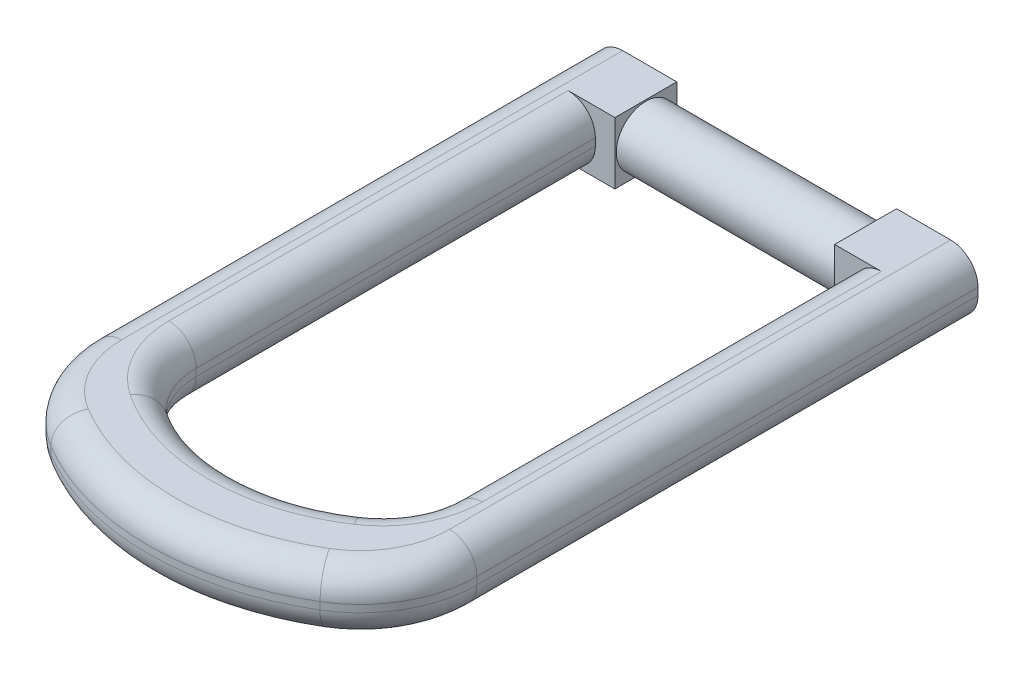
ISO-10303-21;
HEADER;
FILE_DESCRIPTION(('STEP AP214'),'2;1');
FILE_NAME('part.step','',(''),(''),'','','');
FILE_SCHEMA(('AUTOMOTIVE_DESIGN { 1 0 10303 214 1 1 1 1 }'));
ENDSEC;
DATA;
#1=APPLICATION_CONTEXT('core data for automotive mechanical design processes');
#2=APPLICATION_PROTOCOL_DEFINITION('international standard','automotive_design',2000,#1);
#3=PRODUCT_CONTEXT('',#1,'mechanical');
#4=PRODUCT('Part','Part','',(#3));
#5=PRODUCT_RELATED_PRODUCT_CATEGORY('part','',(#4));
#6=PRODUCT_DEFINITION_FORMATION('','',#4);
#7=PRODUCT_DEFINITION_CONTEXT('part definition',#1,'design');
#8=PRODUCT_DEFINITION('design','',#6,#7);
#9=PRODUCT_DEFINITION_SHAPE('','',#8);
#10=(LENGTH_UNIT() NAMED_UNIT(*) SI_UNIT(.MILLI.,.METRE.));
#11=(NAMED_UNIT(*) PLANE_ANGLE_UNIT() SI_UNIT($,.RADIAN.));
#12=(NAMED_UNIT(*) SI_UNIT($,.STERADIAN.) SOLID_ANGLE_UNIT());
#13=UNCERTAINTY_MEASURE_WITH_UNIT(LENGTH_MEASURE(1.E-05),#10,'distance_accuracy_value','');
#14=(GEOMETRIC_REPRESENTATION_CONTEXT(3) GLOBAL_UNCERTAINTY_ASSIGNED_CONTEXT((#13)) GLOBAL_UNIT_ASSIGNED_CONTEXT((#10,
#11,#12)) REPRESENTATION_CONTEXT('',''));
#15=CARTESIAN_POINT('',(0.,0.,0.));
#16=DIRECTION('',(0.,0.,1.));
#17=DIRECTION('',(1.,0.,0.));
#18=AXIS2_PLACEMENT_3D('',#15,#16,#17);
#19=CARTESIAN_POINT('',(-32.9,-13.6,206.712725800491));
#20=DIRECTION('',(0.,1.,0.));
#21=DIRECTION('',(-1.,0.,0.));
#22=AXIS2_PLACEMENT_3D('',#19,#20,#21);
#23=PLANE('',#22);
#24=DIRECTION('',(1.,0.,0.));
#25=VECTOR('',#24,1.);
#26=CARTESIAN_POINT('',(-84.1,-13.6,-13.6));
#27=LINE('',#26,#25);
#28=CARTESIAN_POINT('',(48.3,-13.6,-13.6));
#29=VERTEX_POINT('',#28);
#30=CARTESIAN_POINT('',(72.1,-13.6,-13.6));
#31=VERTEX_POINT('',#30);
#32=EDGE_CURVE('E379',#29,#31,#27,.T.);
#33=ORIENTED_EDGE('',*,*,#32,.T.);
#34=DIRECTION('',(0.,0.,1.));
#35=VECTOR('',#34,1.);
#36=CARTESIAN_POINT('',(72.1,-13.6,206.712725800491));
#37=LINE('',#36,#35);
#38=CARTESIAN_POINT('',(72.1,-13.6,206.712725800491));
#39=VERTEX_POINT('',#38);
#40=EDGE_CURVE('E248',#31,#39,#37,.T.);
#41=ORIENTED_EDGE('',*,*,#40,.T.);
#42=CARTESIAN_POINT('',(32.9,-13.6,206.712725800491));
#43=DIRECTION('',(0.,1.,0.));
#44=DIRECTION('',(-1.,0.,0.));
#45=AXIS2_PLACEMENT_3D('',#42,#43,#44);
#46=CIRCLE('',#45,39.2);
#47=CARTESIAN_POINT('',(53.0198127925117,-13.6,240.355453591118));
#48=VERTEX_POINT('',#47);
#49=EDGE_CURVE('E246',#39,#48,#46,.F.);
#50=ORIENTED_EDGE('',*,*,#49,.T.);
#51=CARTESIAN_POINT('',(0.,-13.6,151.7));
#52=DIRECTION('',(0.,1.,0.));
#53=DIRECTION('',(-1.,0.,0.));
#54=AXIS2_PLACEMENT_3D('',#51,#52,#53);
#55=CIRCLE('',#54,103.3);
#56=CARTESIAN_POINT('',(-53.0198127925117,-13.6,240.355453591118));
#57=VERTEX_POINT('',#56);
#58=EDGE_CURVE('E244',#48,#57,#55,.F.);
#59=ORIENTED_EDGE('',*,*,#58,.T.);
#60=CARTESIAN_POINT('',(-32.9,-13.6,206.712725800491));
#61=DIRECTION('',(0.,1.,0.));
#62=DIRECTION('',(-1.,0.,0.));
#63=AXIS2_PLACEMENT_3D('',#60,#61,#62);
#64=CIRCLE('',#63,39.2);
#65=CARTESIAN_POINT('',(-72.1,-13.6,206.712725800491));
#66=VERTEX_POINT('',#65);
#67=EDGE_CURVE('E242',#57,#66,#64,.F.);
#68=ORIENTED_EDGE('',*,*,#67,.T.);
#69=DIRECTION('',(0.,0.,-1.));
#70=VECTOR('',#69,1.);
#71=CARTESIAN_POINT('',(-72.1,-13.6,206.712725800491));
#72=LINE('',#71,#70);
#73=CARTESIAN_POINT('',(-72.1,-13.6,-13.6));
#74=VERTEX_POINT('',#73);
#75=EDGE_CURVE('E240',#66,#74,#72,.T.);
#76=ORIENTED_EDGE('',*,*,#75,.T.);
#77=CARTESIAN_POINT('',(-48.3,-13.6,-13.6));
#78=VERTEX_POINT('',#77);
#79=EDGE_CURVE('E222',#74,#78,#27,.T.);
#80=ORIENTED_EDGE('',*,*,#79,.T.);
#81=DIRECTION('',(0.,0.,1.));
#82=VECTOR('',#81,1.);
#83=CARTESIAN_POINT('',(-48.3,-13.6,30.5));
#84=LINE('',#83,#82);
#85=CARTESIAN_POINT('',(-48.3,-13.6,13.6));
#86=VERTEX_POINT('',#85);
#87=EDGE_CURVE('E203',#78,#86,#84,.T.);
#88=ORIENTED_EDGE('',*,*,#87,.T.);
#89=DIRECTION('',(1.,0.,0.));
#90=VECTOR('',#89,1.);
#91=CARTESIAN_POINT('',(-56.9,-13.6,13.6));
#92=LINE('',#91,#90);
#93=CARTESIAN_POINT('',(-68.9,-13.6,13.6));
#94=VERTEX_POINT('',#93);
#95=EDGE_CURVE('E211',#94,#86,#92,.T.);
#96=ORIENTED_EDGE('',*,*,#95,.F.);
#97=DIRECTION('',(0.,0.,-1.));
#98=VECTOR('',#97,1.);
#99=CARTESIAN_POINT('',(-68.9,-13.6,189.063083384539));
#100=LINE('',#99,#98);
#101=CARTESIAN_POINT('',(-68.9,-13.6,189.063083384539));
#102=VERTEX_POINT('',#101);
#103=EDGE_CURVE('E226',#94,#102,#100,.F.);
#104=ORIENTED_EDGE('',*,*,#103,.T.);
#105=CARTESIAN_POINT('',(-24.9,-13.6,189.063083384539));
#106=DIRECTION('',(0.,1.,0.));
#107=DIRECTION('',(-1.,0.,0.));
#108=AXIS2_PLACEMENT_3D('',#105,#106,#107);
#109=CIRCLE('',#108,44.);
#110=CARTESIAN_POINT('',(-49.3008908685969,-13.6,225.677240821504));
#111=VERTEX_POINT('',#110);
#112=EDGE_CURVE('E231',#102,#111,#109,.T.);
#113=ORIENTED_EDGE('',*,*,#112,.T.);
#114=CARTESIAN_POINT('',(0.,-13.6,151.7));
#115=DIRECTION('',(0.,1.,0.));
#116=DIRECTION('',(-1.,0.,0.));
#117=AXIS2_PLACEMENT_3D('',#114,#115,#116);
#118=CIRCLE('',#117,88.9);
#119=CARTESIAN_POINT('',(49.3008908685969,-13.6,225.677240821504));
#120=VERTEX_POINT('',#119);
#121=EDGE_CURVE('E233',#111,#120,#118,.T.);
#122=ORIENTED_EDGE('',*,*,#121,.T.);
#123=CARTESIAN_POINT('',(24.9,-13.6,189.063083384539));
#124=DIRECTION('',(0.,1.,0.));
#125=DIRECTION('',(-1.,0.,0.));
#126=AXIS2_PLACEMENT_3D('',#123,#124,#125);
#127=CIRCLE('',#126,44.);
#128=CARTESIAN_POINT('',(68.9,-13.6,189.063083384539));
#129=VERTEX_POINT('',#128);
#130=EDGE_CURVE('E235',#120,#129,#127,.T.);
#131=ORIENTED_EDGE('',*,*,#130,.T.);
#132=DIRECTION('',(0.,0.,1.));
#133=VECTOR('',#132,1.);
#134=CARTESIAN_POINT('',(68.9,-13.6,13.6));
#135=LINE('',#134,#133);
#136=CARTESIAN_POINT('',(68.9,-13.6,13.6));
#137=VERTEX_POINT('',#136);
#138=EDGE_CURVE('E237',#129,#137,#135,.F.);
#139=ORIENTED_EDGE('',*,*,#138,.T.);
#140=CARTESIAN_POINT('',(48.3,-13.6,13.6));
#141=VERTEX_POINT('',#140);
#142=EDGE_CURVE('E218',#141,#137,#92,.T.);
#143=ORIENTED_EDGE('',*,*,#142,.F.);
#144=DIRECTION('',(0.,0.,-1.));
#145=VECTOR('',#144,1.);
#146=CARTESIAN_POINT('',(48.3,-13.6,30.5));
#147=LINE('',#146,#145);
#148=EDGE_CURVE('E208',#141,#29,#147,.T.);
#149=ORIENTED_EDGE('',*,*,#148,.T.);
#150=EDGE_LOOP('',(#33,#41,#50,#59,#68,#76,#80,#88,#96,#104,#113,#122,#131,#139,#143,#149));
#151=FACE_BOUND('',#150,.T.);
#152=ADVANCED_FACE('F14',(#151),#23,.F.);
#153=CARTESIAN_POINT('',(-32.9,13.6,206.712725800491));
#154=DIRECTION('',(0.,1.,0.));
#155=DIRECTION('',(-1.,0.,0.));
#156=AXIS2_PLACEMENT_3D('',#153,#154,#155);
#157=PLANE('',#156);
#158=CARTESIAN_POINT('',(32.9,13.6,206.712725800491));
#159=DIRECTION('',(0.,1.,0.));
#160=DIRECTION('',(-1.,0.,0.));
#161=AXIS2_PLACEMENT_3D('',#158,#159,#160);
#162=CIRCLE('',#161,39.2);
#163=CARTESIAN_POINT('',(53.0198127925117,13.6,240.355453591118));
#164=VERTEX_POINT('',#163);
#165=CARTESIAN_POINT('',(72.1,13.6,206.712725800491));
#166=VERTEX_POINT('',#165);
#167=EDGE_CURVE('E286',#164,#166,#162,.T.);
#168=ORIENTED_EDGE('',*,*,#167,.T.);
#169=DIRECTION('',(0.,0.,1.));
#170=VECTOR('',#169,1.);
#171=CARTESIAN_POINT('',(72.1,13.6,-13.6));
#172=LINE('',#171,#170);
#173=CARTESIAN_POINT('',(72.1,13.6,-13.6));
#174=VERTEX_POINT('',#173);
#175=EDGE_CURVE('E288',#166,#174,#172,.F.);
#176=ORIENTED_EDGE('',*,*,#175,.T.);
#177=DIRECTION('',(1.,0.,0.));
#178=VECTOR('',#177,1.);
#179=CARTESIAN_POINT('',(-84.1,13.6,-13.6));
#180=LINE('',#179,#178);
#181=CARTESIAN_POINT('',(48.3,13.6,-13.6));
#182=VERTEX_POINT('',#181);
#183=EDGE_CURVE('E375',#182,#174,#180,.T.);
#184=ORIENTED_EDGE('',*,*,#183,.F.);
#185=DIRECTION('',(0.,0.,-1.));
#186=VECTOR('',#185,1.);
#187=CARTESIAN_POINT('',(48.3,13.6,30.5));
#188=LINE('',#187,#186);
#189=CARTESIAN_POINT('',(48.3,13.6,13.6));
#190=VERTEX_POINT('',#189);
#191=EDGE_CURVE('E345',#190,#182,#188,.T.);
#192=ORIENTED_EDGE('',*,*,#191,.F.);
#193=DIRECTION('',(1.,0.,0.));
#194=VECTOR('',#193,1.);
#195=CARTESIAN_POINT('',(-56.9,13.6,13.6));
#196=LINE('',#195,#194);
#197=CARTESIAN_POINT('',(68.9,13.6,13.6));
#198=VERTEX_POINT('',#197);
#199=EDGE_CURVE('E349',#190,#198,#196,.T.);
#200=ORIENTED_EDGE('',*,*,#199,.T.);
#201=DIRECTION('',(0.,0.,1.));
#202=VECTOR('',#201,1.);
#203=CARTESIAN_POINT('',(68.9,13.6,206.712725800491));
#204=LINE('',#203,#202);
#205=CARTESIAN_POINT('',(68.9,13.6,189.063083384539));
#206=VERTEX_POINT('',#205);
#207=EDGE_CURVE('E278',#198,#206,#204,.T.);
#208=ORIENTED_EDGE('',*,*,#207,.T.);
#209=CARTESIAN_POINT('',(24.9,13.6,189.063083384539));
#210=DIRECTION('',(0.,1.,0.));
#211=DIRECTION('',(-1.,0.,0.));
#212=AXIS2_PLACEMENT_3D('',#209,#210,#211);
#213=CIRCLE('',#212,44.);
#214=CARTESIAN_POINT('',(49.3008908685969,13.6,225.677240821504));
#215=VERTEX_POINT('',#214);
#216=EDGE_CURVE('E276',#206,#215,#213,.F.);
#217=ORIENTED_EDGE('',*,*,#216,.T.);
#218=CARTESIAN_POINT('',(0.,13.6,151.7));
#219=DIRECTION('',(0.,1.,0.));
#220=DIRECTION('',(-1.,0.,0.));
#221=AXIS2_PLACEMENT_3D('',#218,#219,#220);
#222=CIRCLE('',#221,88.9);
#223=CARTESIAN_POINT('',(-49.3008908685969,13.6,225.677240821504));
#224=VERTEX_POINT('',#223);
#225=EDGE_CURVE('E273',#215,#224,#222,.F.);
#226=ORIENTED_EDGE('',*,*,#225,.T.);
#227=CARTESIAN_POINT('',(-24.9,13.6,189.063083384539));
#228=DIRECTION('',(0.,1.,0.));
#229=DIRECTION('',(-1.,0.,0.));
#230=AXIS2_PLACEMENT_3D('',#227,#228,#229);
#231=CIRCLE('',#230,44.);
#232=CARTESIAN_POINT('',(-68.9,13.6,189.063083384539));
#233=VERTEX_POINT('',#232);
#234=EDGE_CURVE('E271',#224,#233,#231,.F.);
#235=ORIENTED_EDGE('',*,*,#234,.T.);
#236=DIRECTION('',(0.,0.,-1.));
#237=VECTOR('',#236,1.);
#238=CARTESIAN_POINT('',(-68.9,13.6,206.712725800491));
#239=LINE('',#238,#237);
#240=CARTESIAN_POINT('',(-68.9,13.6,13.6));
#241=VERTEX_POINT('',#240);
#242=EDGE_CURVE('E268',#233,#241,#239,.T.);
#243=ORIENTED_EDGE('',*,*,#242,.T.);
#244=CARTESIAN_POINT('',(-48.3,13.6,13.6));
#245=VERTEX_POINT('',#244);
#246=EDGE_CURVE('E355',#241,#245,#196,.T.);
#247=ORIENTED_EDGE('',*,*,#246,.T.);
#248=DIRECTION('',(0.,0.,1.));
#249=VECTOR('',#248,1.);
#250=CARTESIAN_POINT('',(-48.3,13.6,30.5));
#251=LINE('',#250,#249);
#252=CARTESIAN_POINT('',(-48.3,13.6,-13.6));
#253=VERTEX_POINT('',#252);
#254=EDGE_CURVE('E206',#253,#245,#251,.T.);
#255=ORIENTED_EDGE('',*,*,#254,.F.);
#256=CARTESIAN_POINT('',(-72.1,13.6,-13.6));
#257=VERTEX_POINT('',#256);
#258=EDGE_CURVE('E376',#257,#253,#180,.T.);
#259=ORIENTED_EDGE('',*,*,#258,.F.);
#260=DIRECTION('',(0.,0.,-1.));
#261=VECTOR('',#260,1.);
#262=CARTESIAN_POINT('',(-72.1,13.6,206.712725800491));
#263=LINE('',#262,#261);
#264=CARTESIAN_POINT('',(-72.1,13.6,206.712725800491));
#265=VERTEX_POINT('',#264);
#266=EDGE_CURVE('E280',#257,#265,#263,.F.);
#267=ORIENTED_EDGE('',*,*,#266,.T.);
#268=CARTESIAN_POINT('',(-32.9,13.6,206.712725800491));
#269=DIRECTION('',(0.,1.,0.));
#270=DIRECTION('',(-1.,0.,0.));
#271=AXIS2_PLACEMENT_3D('',#268,#269,#270);
#272=CIRCLE('',#271,39.2);
#273=CARTESIAN_POINT('',(-53.0198127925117,13.6,240.355453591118));
#274=VERTEX_POINT('',#273);
#275=EDGE_CURVE('E282',#265,#274,#272,.T.);
#276=ORIENTED_EDGE('',*,*,#275,.T.);
#277=CARTESIAN_POINT('',(0.,13.6,151.7));
#278=DIRECTION('',(0.,1.,0.));
#279=DIRECTION('',(-1.,0.,0.));
#280=AXIS2_PLACEMENT_3D('',#277,#278,#279);
#281=CIRCLE('',#280,103.3);
#282=EDGE_CURVE('E284',#274,#164,#281,.T.);
#283=ORIENTED_EDGE('',*,*,#282,.T.);
#284=EDGE_LOOP('',(#168,#176,#184,#192,#200,#208,#217,#226,#235,#243,#247,#255,#259,#267,#276,#283));
#285=FACE_BOUND('',#284,.T.);
#286=ADVANCED_FACE('F406',(#285),#157,.T.);
#287=CARTESIAN_POINT('',(-84.1,-13.6,-13.6));
#288=DIRECTION('',(0.,0.,1.));
#289=DIRECTION('',(0.,1.,0.));
#290=AXIS2_PLACEMENT_3D('',#287,#288,#289);
#291=PLANE('',#290);
#292=DIRECTION('',(0.,1.,0.));
#293=VECTOR('',#292,1.);
#294=CARTESIAN_POINT('',(84.1,-13.6,-13.6));
#295=LINE('',#294,#293);
#296=CARTESIAN_POINT('',(84.1,-1.6,-13.6));
#297=VERTEX_POINT('',#296);
#298=CARTESIAN_POINT('',(84.1,1.6,-13.6));
#299=VERTEX_POINT('',#298);
#300=EDGE_CURVE('E381',#297,#299,#295,.T.);
#301=ORIENTED_EDGE('',*,*,#300,.F.);
#302=CARTESIAN_POINT('',(72.1,-1.6,-13.6));
#303=DIRECTION('',(0.,0.,1.));
#304=DIRECTION('',(0.,1.,0.));
#305=AXIS2_PLACEMENT_3D('',#302,#303,#304);
#306=CIRCLE('',#305,12.);
#307=EDGE_CURVE('E257',#297,#31,#306,.F.);
#308=ORIENTED_EDGE('',*,*,#307,.T.);
#309=ORIENTED_EDGE('',*,*,#32,.F.);
#310=DIRECTION('',(0.,1.,0.));
#311=VECTOR('',#310,1.);
#312=CARTESIAN_POINT('',(48.3,30.8,-13.6));
#313=LINE('',#312,#311);
#314=EDGE_CURVE('E342',#29,#182,#313,.T.);
#315=ORIENTED_EDGE('',*,*,#314,.T.);
#316=ORIENTED_EDGE('',*,*,#183,.T.);
#317=CARTESIAN_POINT('',(72.1,1.6,-13.6));
#318=DIRECTION('',(0.,0.,1.));
#319=DIRECTION('',(0.,1.,0.));
#320=AXIS2_PLACEMENT_3D('',#317,#318,#319);
#321=CIRCLE('',#320,12.);
#322=EDGE_CURVE('E255',#174,#299,#321,.F.);
#323=ORIENTED_EDGE('',*,*,#322,.T.);
#324=EDGE_LOOP('',(#301,#308,#309,#315,#316,#323));
#325=FACE_BOUND('',#324,.T.);
#326=ADVANCED_FACE('F404',(#325),#291,.F.);
#327=DIRECTION('',(0.,1.,0.));
#328=VECTOR('',#327,1.);
#329=CARTESIAN_POINT('',(-84.1,-13.6,-13.6));
#330=LINE('',#329,#328);
#331=CARTESIAN_POINT('',(-84.1,-1.6,-13.6));
#332=VERTEX_POINT('',#331);
#333=CARTESIAN_POINT('',(-84.1,1.6,-13.6));
#334=VERTEX_POINT('',#333);
#335=EDGE_CURVE('E384',#332,#334,#330,.T.);
#336=ORIENTED_EDGE('',*,*,#335,.T.);
#337=CARTESIAN_POINT('',(-72.1,1.6,-13.6));
#338=DIRECTION('',(0.,0.,1.));
#339=DIRECTION('',(0.,1.,0.));
#340=AXIS2_PLACEMENT_3D('',#337,#338,#339);
#341=CIRCLE('',#340,12.);
#342=EDGE_CURVE('E317',#334,#257,#341,.F.);
#343=ORIENTED_EDGE('',*,*,#342,.T.);
#344=ORIENTED_EDGE('',*,*,#258,.T.);
#345=DIRECTION('',(0.,-1.,0.));
#346=VECTOR('',#345,1.);
#347=CARTESIAN_POINT('',(-48.3,30.8,-13.6));
#348=LINE('',#347,#346);
#349=EDGE_CURVE('E224',#253,#78,#348,.T.);
#350=ORIENTED_EDGE('',*,*,#349,.T.);
#351=ORIENTED_EDGE('',*,*,#79,.F.);
#352=CARTESIAN_POINT('',(-72.1,-1.6,-13.6));
#353=DIRECTION('',(0.,0.,1.));
#354=DIRECTION('',(0.,1.,0.));
#355=AXIS2_PLACEMENT_3D('',#352,#353,#354);
#356=CIRCLE('',#355,12.);
#357=EDGE_CURVE('E315',#74,#332,#356,.F.);
#358=ORIENTED_EDGE('',*,*,#357,.T.);
#359=EDGE_LOOP('',(#336,#343,#344,#350,#351,#358));
#360=FACE_BOUND('',#359,.T.);
#361=ADVANCED_FACE('F520',(#360),#291,.F.);
#362=CARTESIAN_POINT('',(-56.9,-13.6,13.6));
#363=DIRECTION('',(0.,0.,1.));
#364=DIRECTION('',(0.,1.,0.));
#365=AXIS2_PLACEMENT_3D('',#362,#363,#364);
#366=PLANE('',#365);
#367=DIRECTION('',(0.,1.,0.));
#368=VECTOR('',#367,1.);
#369=CARTESIAN_POINT('',(48.3,30.8,13.6));
#370=LINE('',#369,#368);
#371=EDGE_CURVE('E339',#141,#190,#370,.T.);
#372=ORIENTED_EDGE('',*,*,#371,.F.);
#373=ORIENTED_EDGE('',*,*,#142,.T.);
#374=CARTESIAN_POINT('',(68.9,-1.6,13.6));
#375=DIRECTION('',(0.,0.,1.));
#376=DIRECTION('',(0.,1.,0.));
#377=AXIS2_PLACEMENT_3D('',#374,#375,#376);
#378=CIRCLE('',#377,12.);
#379=CARTESIAN_POINT('',(56.9,-1.6,13.6));
#380=VERTEX_POINT('',#379);
#381=EDGE_CURVE('E325',#137,#380,#378,.F.);
#382=ORIENTED_EDGE('',*,*,#381,.T.);
#383=DIRECTION('',(0.,1.,0.));
#384=VECTOR('',#383,1.);
#385=CARTESIAN_POINT('',(56.9,-13.6,13.6));
#386=LINE('',#385,#384);
#387=CARTESIAN_POINT('',(56.9,1.6,13.6));
#388=VERTEX_POINT('',#387);
#389=EDGE_CURVE('E372',#380,#388,#386,.T.);
#390=ORIENTED_EDGE('',*,*,#389,.T.);
#391=CARTESIAN_POINT('',(68.9,1.6,13.6));
#392=DIRECTION('',(0.,0.,1.));
#393=DIRECTION('',(0.,1.,0.));
#394=AXIS2_PLACEMENT_3D('',#391,#392,#393);
#395=CIRCLE('',#394,12.);
#396=EDGE_CURVE('E322',#388,#198,#395,.F.);
#397=ORIENTED_EDGE('',*,*,#396,.T.);
#398=ORIENTED_EDGE('',*,*,#199,.F.);
#399=EDGE_LOOP('',(#372,#373,#382,#390,#397,#398));
#400=FACE_BOUND('',#399,.T.);
#401=ADVANCED_FACE('F348',(#400),#366,.T.);
#402=DIRECTION('',(0.,-1.,0.));
#403=VECTOR('',#402,1.);
#404=CARTESIAN_POINT('',(-48.3,30.8,13.6));
#405=LINE('',#404,#403);
#406=EDGE_CURVE('E199',#245,#86,#405,.T.);
#407=ORIENTED_EDGE('',*,*,#406,.F.);
#408=ORIENTED_EDGE('',*,*,#246,.F.);
#409=CARTESIAN_POINT('',(-68.9,1.6,13.6));
#410=DIRECTION('',(0.,0.,1.));
#411=DIRECTION('',(0.,1.,0.));
#412=AXIS2_PLACEMENT_3D('',#409,#410,#411);
#413=CIRCLE('',#412,12.);
#414=CARTESIAN_POINT('',(-56.9,1.6,13.6));
#415=VERTEX_POINT('',#414);
#416=EDGE_CURVE('E29',#241,#415,#413,.F.);
#417=ORIENTED_EDGE('',*,*,#416,.T.);
#418=DIRECTION('',(0.,1.,0.));
#419=VECTOR('',#418,1.);
#420=CARTESIAN_POINT('',(-56.9,-13.6,13.6));
#421=LINE('',#420,#419);
#422=CARTESIAN_POINT('',(-56.9,-1.6,13.6));
#423=VERTEX_POINT('',#422);
#424=EDGE_CURVE('E217',#423,#415,#421,.T.);
#425=ORIENTED_EDGE('',*,*,#424,.F.);
#426=CARTESIAN_POINT('',(-68.9,-1.6,13.6));
#427=DIRECTION('',(0.,0.,1.));
#428=DIRECTION('',(0.,1.,0.));
#429=AXIS2_PLACEMENT_3D('',#426,#427,#428);
#430=CIRCLE('',#429,12.);
#431=EDGE_CURVE('E214',#423,#94,#430,.F.);
#432=ORIENTED_EDGE('',*,*,#431,.T.);
#433=ORIENTED_EDGE('',*,*,#95,.T.);
#434=EDGE_LOOP('',(#407,#408,#417,#425,#432,#433));
#435=FACE_BOUND('',#434,.T.);
#436=ADVANCED_FACE('F212',(#435),#366,.T.);
#437=CARTESIAN_POINT('',(84.1,-13.6,206.712725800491));
#438=DIRECTION('',(-1.,0.,0.));
#439=DIRECTION('',(0.,0.,1.));
#440=AXIS2_PLACEMENT_3D('',#437,#438,#439);
#441=PLANE('',#440);
#442=DIRECTION('',(0.,1.,0.));
#443=VECTOR('',#442,1.);
#444=CARTESIAN_POINT('',(84.1,-13.6,206.712725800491));
#445=LINE('',#444,#443);
#446=CARTESIAN_POINT('',(84.1,-1.6,206.712725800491));
#447=VERTEX_POINT('',#446);
#448=CARTESIAN_POINT('',(84.1,1.6,206.712725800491));
#449=VERTEX_POINT('',#448);
#450=EDGE_CURVE('E351',#447,#449,#445,.T.);
#451=ORIENTED_EDGE('',*,*,#450,.F.);
#452=DIRECTION('',(0.,0.,1.));
#453=VECTOR('',#452,1.);
#454=CARTESIAN_POINT('',(84.1,-1.6,206.712725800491));
#455=LINE('',#454,#453);
#456=EDGE_CURVE('E253',#447,#297,#455,.F.);
#457=ORIENTED_EDGE('',*,*,#456,.T.);
#458=ORIENTED_EDGE('',*,*,#300,.T.);
#459=DIRECTION('',(0.,0.,1.));
#460=VECTOR('',#459,1.);
#461=CARTESIAN_POINT('',(84.1,1.6,206.712725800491));
#462=LINE('',#461,#460);
#463=EDGE_CURVE('E251',#299,#449,#462,.T.);
#464=ORIENTED_EDGE('',*,*,#463,.T.);
#465=EDGE_LOOP('',(#451,#457,#458,#464));
#466=FACE_BOUND('',#465,.T.);
#467=ADVANCED_FACE('F16',(#466),#441,.F.);
#468=CARTESIAN_POINT('',(32.9,-13.6,206.712725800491));
#469=DIRECTION('',(0.,1.,0.));
#470=DIRECTION('',(-1.,0.,0.));
#471=AXIS2_PLACEMENT_3D('',#468,#469,#470);
#472=CYLINDRICAL_SURFACE('',#471,51.2);
#473=DIRECTION('',(0.,1.,0.));
#474=VECTOR('',#473,1.);
#475=CARTESIAN_POINT('',(59.1789391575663,-13.6,250.654247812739));
#476=LINE('',#475,#474);
#477=CARTESIAN_POINT('',(59.1789391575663,-1.6,250.654247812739));
#478=VERTEX_POINT('',#477);
#479=CARTESIAN_POINT('',(59.1789391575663,1.6,250.654247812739));
#480=VERTEX_POINT('',#479);
#481=EDGE_CURVE('E393',#478,#480,#476,.T.);
#482=ORIENTED_EDGE('',*,*,#481,.F.);
#483=CARTESIAN_POINT('',(32.9,-1.6,206.712725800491));
#484=DIRECTION('',(0.,1.,0.));
#485=DIRECTION('',(-1.,0.,0.));
#486=AXIS2_PLACEMENT_3D('',#483,#484,#485);
#487=CIRCLE('',#486,51.2);
#488=EDGE_CURVE('E261',#478,#447,#487,.T.);
#489=ORIENTED_EDGE('',*,*,#488,.T.);
#490=ORIENTED_EDGE('',*,*,#450,.T.);
#491=CARTESIAN_POINT('',(32.9,1.6,206.712725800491));
#492=DIRECTION('',(0.,1.,0.));
#493=DIRECTION('',(-1.,0.,0.));
#494=AXIS2_PLACEMENT_3D('',#491,#492,#493);
#495=CIRCLE('',#494,51.2);
#496=EDGE_CURVE('E259',#449,#480,#495,.F.);
#497=ORIENTED_EDGE('',*,*,#496,.T.);
#498=EDGE_LOOP('',(#482,#489,#490,#497));
#499=FACE_BOUND('',#498,.T.);
#500=ADVANCED_FACE('F501',(#499),#472,.T.);
#501=CARTESIAN_POINT('',(0.,-13.6,151.7));
#502=DIRECTION('',(0.,1.,0.));
#503=DIRECTION('',(-1.,0.,0.));
#504=AXIS2_PLACEMENT_3D('',#501,#502,#503);
#505=CYLINDRICAL_SURFACE('',#504,115.3);
#506=ORIENTED_EDGE('',*,*,#481,.T.);
#507=CARTESIAN_POINT('',(0.,1.6,151.7));
#508=DIRECTION('',(0.,1.,0.));
#509=DIRECTION('',(-1.,0.,0.));
#510=AXIS2_PLACEMENT_3D('',#507,#508,#509);
#511=CIRCLE('',#510,115.3);
#512=CARTESIAN_POINT('',(-59.1789391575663,1.6,250.654247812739));
#513=VERTEX_POINT('',#512);
#514=EDGE_CURVE('E265',#480,#513,#511,.F.);
#515=ORIENTED_EDGE('',*,*,#514,.T.);
#516=DIRECTION('',(0.,1.,0.));
#517=VECTOR('',#516,1.);
#518=CARTESIAN_POINT('',(-59.1789391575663,-13.6,250.654247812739));
#519=LINE('',#518,#517);
#520=CARTESIAN_POINT('',(-59.1789391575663,-1.6,250.654247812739));
#521=VERTEX_POINT('',#520);
#522=EDGE_CURVE('E390',#521,#513,#519,.T.);
#523=ORIENTED_EDGE('',*,*,#522,.F.);
#524=CARTESIAN_POINT('',(0.,-1.6,151.7));
#525=DIRECTION('',(0.,1.,0.));
#526=DIRECTION('',(-1.,0.,0.));
#527=AXIS2_PLACEMENT_3D('',#524,#525,#526);
#528=CIRCLE('',#527,115.3);
#529=EDGE_CURVE('E263',#521,#478,#528,.T.);
#530=ORIENTED_EDGE('',*,*,#529,.T.);
#531=EDGE_LOOP('',(#506,#515,#523,#530));
#532=FACE_BOUND('',#531,.T.);
#533=ADVANCED_FACE('F487',(#532),#505,.T.);
#534=CARTESIAN_POINT('',(-32.9,-13.6,206.712725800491));
#535=DIRECTION('',(0.,1.,0.));
#536=DIRECTION('',(-1.,0.,0.));
#537=AXIS2_PLACEMENT_3D('',#534,#535,#536);
#538=CYLINDRICAL_SURFACE('',#537,51.2);
#539=ORIENTED_EDGE('',*,*,#522,.T.);
#540=CARTESIAN_POINT('',(-32.9,1.6,206.712725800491));
#541=DIRECTION('',(0.,1.,0.));
#542=DIRECTION('',(-1.,0.,0.));
#543=AXIS2_PLACEMENT_3D('',#540,#541,#542);
#544=CIRCLE('',#543,51.2);
#545=CARTESIAN_POINT('',(-84.1,1.6,206.712725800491));
#546=VERTEX_POINT('',#545);
#547=EDGE_CURVE('E301',#513,#546,#544,.F.);
#548=ORIENTED_EDGE('',*,*,#547,.T.);
#549=DIRECTION('',(0.,1.,0.));
#550=VECTOR('',#549,1.);
#551=CARTESIAN_POINT('',(-84.1,-13.6,206.712725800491));
#552=LINE('',#551,#550);
#553=CARTESIAN_POINT('',(-84.1,-1.6,206.712725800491));
#554=VERTEX_POINT('',#553);
#555=EDGE_CURVE('E387',#554,#546,#552,.T.);
#556=ORIENTED_EDGE('',*,*,#555,.F.);
#557=CARTESIAN_POINT('',(-32.9,-1.6,206.712725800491));
#558=DIRECTION('',(0.,1.,0.));
#559=DIRECTION('',(-1.,0.,0.));
#560=AXIS2_PLACEMENT_3D('',#557,#558,#559);
#561=CIRCLE('',#560,51.2);
#562=EDGE_CURVE('E299',#554,#521,#561,.T.);
#563=ORIENTED_EDGE('',*,*,#562,.T.);
#564=EDGE_LOOP('',(#539,#548,#556,#563));
#565=FACE_BOUND('',#564,.T.);
#566=ADVANCED_FACE('F491',(#565),#538,.T.);
#567=CARTESIAN_POINT('',(-84.1,-13.6,206.712725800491));
#568=DIRECTION('',(1.,0.,0.));
#569=DIRECTION('',(0.,0.,-1.));
#570=AXIS2_PLACEMENT_3D('',#567,#568,#569);
#571=PLANE('',#570);
#572=ORIENTED_EDGE('',*,*,#555,.T.);
#573=DIRECTION('',(0.,0.,-1.));
#574=VECTOR('',#573,1.);
#575=CARTESIAN_POINT('',(-84.1,1.6,-13.6));
#576=LINE('',#575,#574);
#577=EDGE_CURVE('E313',#546,#334,#576,.T.);
#578=ORIENTED_EDGE('',*,*,#577,.T.);
#579=ORIENTED_EDGE('',*,*,#335,.F.);
#580=DIRECTION('',(0.,0.,-1.));
#581=VECTOR('',#580,1.);
#582=CARTESIAN_POINT('',(-84.1,-1.6,206.712725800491));
#583=LINE('',#582,#581);
#584=EDGE_CURVE('E311',#332,#554,#583,.F.);
#585=ORIENTED_EDGE('',*,*,#584,.T.);
#586=EDGE_LOOP('',(#572,#578,#579,#585));
#587=FACE_BOUND('',#586,.T.);
#588=ADVANCED_FACE('F523',(#587),#571,.F.);
#589=CARTESIAN_POINT('',(56.9,-13.6,189.063083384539));
#590=DIRECTION('',(-1.,0.,0.));
#591=DIRECTION('',(0.,0.,1.));
#592=AXIS2_PLACEMENT_3D('',#589,#590,#591);
#593=PLANE('',#592);
#594=DIRECTION('',(0.,1.,0.));
#595=VECTOR('',#594,1.);
#596=CARTESIAN_POINT('',(56.9,-13.6,189.063083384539));
#597=LINE('',#596,#595);
#598=CARTESIAN_POINT('',(56.9,-1.6,189.063083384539));
#599=VERTEX_POINT('',#598);
#600=CARTESIAN_POINT('',(56.9,1.6,189.063083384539));
#601=VERTEX_POINT('',#600);
#602=EDGE_CURVE('E369',#599,#601,#597,.T.);
#603=ORIENTED_EDGE('',*,*,#602,.T.);
#604=DIRECTION('',(0.,0.,1.));
#605=VECTOR('',#604,1.);
#606=CARTESIAN_POINT('',(56.9,1.6,189.063083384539));
#607=LINE('',#606,#605);
#608=EDGE_CURVE('E309',#601,#388,#607,.F.);
#609=ORIENTED_EDGE('',*,*,#608,.T.);
#610=ORIENTED_EDGE('',*,*,#389,.F.);
#611=DIRECTION('',(0.,0.,1.));
#612=VECTOR('',#611,1.);
#613=CARTESIAN_POINT('',(56.9,-1.6,189.063083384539));
#614=LINE('',#613,#612);
#615=EDGE_CURVE('E307',#380,#599,#614,.T.);
#616=ORIENTED_EDGE('',*,*,#615,.T.);
#617=EDGE_LOOP('',(#603,#609,#610,#616));
#618=FACE_BOUND('',#617,.T.);
#619=ADVANCED_FACE('F571',(#618),#593,.T.);
#620=CARTESIAN_POINT('',(24.9,-13.6,189.063083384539));
#621=DIRECTION('',(0.,1.,0.));
#622=DIRECTION('',(-1.,0.,0.));
#623=AXIS2_PLACEMENT_3D('',#620,#621,#622);
#624=CYLINDRICAL_SURFACE('',#623,32.);
#625=DIRECTION('',(0.,1.,0.));
#626=VECTOR('',#625,1.);
#627=CARTESIAN_POINT('',(42.6461024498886,-13.6,215.691561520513));
#628=LINE('',#627,#626);
#629=CARTESIAN_POINT('',(42.6461024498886,-1.6,215.691561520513));
#630=VERTEX_POINT('',#629);
#631=CARTESIAN_POINT('',(42.6461024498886,1.6,215.691561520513));
#632=VERTEX_POINT('',#631);
#633=EDGE_CURVE('E366',#630,#632,#628,.T.);
#634=ORIENTED_EDGE('',*,*,#633,.T.);
#635=CARTESIAN_POINT('',(24.9,1.6,189.063083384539));
#636=DIRECTION('',(0.,1.,0.));
#637=DIRECTION('',(-1.,0.,0.));
#638=AXIS2_PLACEMENT_3D('',#635,#636,#637);
#639=CIRCLE('',#638,32.);
#640=EDGE_CURVE('E297',#632,#601,#639,.T.);
#641=ORIENTED_EDGE('',*,*,#640,.T.);
#642=ORIENTED_EDGE('',*,*,#602,.F.);
#643=CARTESIAN_POINT('',(24.9,-1.6,189.063083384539));
#644=DIRECTION('',(0.,1.,0.));
#645=DIRECTION('',(-1.,0.,0.));
#646=AXIS2_PLACEMENT_3D('',#643,#644,#645);
#647=CIRCLE('',#646,32.);
#648=EDGE_CURVE('E295',#599,#630,#647,.F.);
#649=ORIENTED_EDGE('',*,*,#648,.T.);
#650=EDGE_LOOP('',(#634,#641,#642,#649));
#651=FACE_BOUND('',#650,.T.);
#652=ADVANCED_FACE('F574',(#651),#624,.F.);
#653=CARTESIAN_POINT('',(0.,-13.6,151.7));
#654=DIRECTION('',(0.,1.,0.));
#655=DIRECTION('',(-1.,0.,0.));
#656=AXIS2_PLACEMENT_3D('',#653,#654,#655);
#657=CYLINDRICAL_SURFACE('',#656,76.9);
#658=DIRECTION('',(0.,1.,0.));
#659=VECTOR('',#658,1.);
#660=CARTESIAN_POINT('',(-42.6461024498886,-13.6,215.691561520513));
#661=LINE('',#660,#659);
#662=CARTESIAN_POINT('',(-42.6461024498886,-1.6,215.691561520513));
#663=VERTEX_POINT('',#662);
#664=CARTESIAN_POINT('',(-42.6461024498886,1.6,215.691561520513));
#665=VERTEX_POINT('',#664);
#666=EDGE_CURVE('E363',#663,#665,#661,.T.);
#667=ORIENTED_EDGE('',*,*,#666,.T.);
#668=CARTESIAN_POINT('',(0.,1.6,151.7));
#669=DIRECTION('',(0.,1.,0.));
#670=DIRECTION('',(-1.,0.,0.));
#671=AXIS2_PLACEMENT_3D('',#668,#669,#670);
#672=CIRCLE('',#671,76.9);
#673=EDGE_CURVE('E293',#665,#632,#672,.T.);
#674=ORIENTED_EDGE('',*,*,#673,.T.);
#675=ORIENTED_EDGE('',*,*,#633,.F.);
#676=CARTESIAN_POINT('',(0.,-1.6,151.7));
#677=DIRECTION('',(0.,1.,0.));
#678=DIRECTION('',(-1.,0.,0.));
#679=AXIS2_PLACEMENT_3D('',#676,#677,#678);
#680=CIRCLE('',#679,76.9);
#681=EDGE_CURVE('E290',#630,#663,#680,.F.);
#682=ORIENTED_EDGE('',*,*,#681,.T.);
#683=EDGE_LOOP('',(#667,#674,#675,#682));
#684=FACE_BOUND('',#683,.T.);
#685=ADVANCED_FACE('F550',(#684),#657,.F.);
#686=CARTESIAN_POINT('',(-24.9,-13.6,189.063083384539));
#687=DIRECTION('',(0.,1.,0.));
#688=DIRECTION('',(-1.,0.,0.));
#689=AXIS2_PLACEMENT_3D('',#686,#687,#688);
#690=CYLINDRICAL_SURFACE('',#689,32.);
#691=DIRECTION('',(0.,1.,0.));
#692=VECTOR('',#691,1.);
#693=CARTESIAN_POINT('',(-56.9,-13.6,189.063083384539));
#694=LINE('',#693,#692);
#695=CARTESIAN_POINT('',(-56.9,-1.6,189.063083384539));
#696=VERTEX_POINT('',#695);
#697=CARTESIAN_POINT('',(-56.9,1.6,189.063083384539));
#698=VERTEX_POINT('',#697);
#699=EDGE_CURVE('E360',#696,#698,#694,.T.);
#700=ORIENTED_EDGE('',*,*,#699,.T.);
#701=CARTESIAN_POINT('',(-24.9,1.6,189.063083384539));
#702=DIRECTION('',(0.,1.,0.));
#703=DIRECTION('',(-1.,0.,0.));
#704=AXIS2_PLACEMENT_3D('',#701,#702,#703);
#705=CIRCLE('',#704,32.);
#706=EDGE_CURVE('E305',#698,#665,#705,.T.);
#707=ORIENTED_EDGE('',*,*,#706,.T.);
#708=ORIENTED_EDGE('',*,*,#666,.F.);
#709=CARTESIAN_POINT('',(-24.9,-1.6,189.063083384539));
#710=DIRECTION('',(0.,1.,0.));
#711=DIRECTION('',(-1.,0.,0.));
#712=AXIS2_PLACEMENT_3D('',#709,#710,#711);
#713=CIRCLE('',#712,32.);
#714=EDGE_CURVE('E303',#663,#696,#713,.F.);
#715=ORIENTED_EDGE('',*,*,#714,.T.);
#716=EDGE_LOOP('',(#700,#707,#708,#715));
#717=FACE_BOUND('',#716,.T.);
#718=ADVANCED_FACE('F536',(#717),#690,.F.);
#719=CARTESIAN_POINT('',(-56.9,-13.6,189.063083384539));
#720=DIRECTION('',(1.,0.,0.));
#721=DIRECTION('',(0.,0.,-1.));
#722=AXIS2_PLACEMENT_3D('',#719,#720,#721);
#723=PLANE('',#722);
#724=ORIENTED_EDGE('',*,*,#424,.T.);
#725=DIRECTION('',(0.,0.,-1.));
#726=VECTOR('',#725,1.);
#727=CARTESIAN_POINT('',(-56.9,1.6,189.063083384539));
#728=LINE('',#727,#726);
#729=EDGE_CURVE('E320',#415,#698,#728,.F.);
#730=ORIENTED_EDGE('',*,*,#729,.T.);
#731=ORIENTED_EDGE('',*,*,#699,.F.);
#732=DIRECTION('',(0.,0.,-1.));
#733=VECTOR('',#732,1.);
#734=CARTESIAN_POINT('',(-56.9,-1.6,13.6));
#735=LINE('',#734,#733);
#736=EDGE_CURVE('E36',#696,#423,#735,.T.);
#737=ORIENTED_EDGE('',*,*,#736,.T.);
#738=EDGE_LOOP('',(#724,#730,#731,#737));
#739=FACE_BOUND('',#738,.T.);
#740=ADVANCED_FACE('F534',(#739),#723,.T.);
#741=CARTESIAN_POINT('',(-72.1,-1.6,206.712725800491));
#742=DIRECTION('',(0.,0.,-1.));
#743=DIRECTION('',(-1.,0.,0.));
#744=AXIS2_PLACEMENT_3D('',#741,#742,#743);
#745=CYLINDRICAL_SURFACE('',#744,12.);
#746=ORIENTED_EDGE('',*,*,#357,.F.);
#747=ORIENTED_EDGE('',*,*,#75,.F.);
#748=CARTESIAN_POINT('',(-72.1,-1.6,206.712725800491));
#749=DIRECTION('',(0.,0.,1.));
#750=DIRECTION('',(0.,1.,0.));
#751=AXIS2_PLACEMENT_3D('',#748,#749,#750);
#752=CIRCLE('',#751,12.);
#753=EDGE_CURVE('E434',#554,#66,#752,.T.);
#754=ORIENTED_EDGE('',*,*,#753,.F.);
#755=ORIENTED_EDGE('',*,*,#584,.F.);
#756=EDGE_LOOP('',(#746,#747,#754,#755));
#757=FACE_BOUND('',#756,.T.);
#758=ADVANCED_FACE('F516',(#757),#745,.T.);
#759=CARTESIAN_POINT('',(-32.9,-1.6,206.712725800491));
#760=DIRECTION('',(0.,1.,0.));
#761=DIRECTION('',(-1.,0.,0.));
#762=AXIS2_PLACEMENT_3D('',#759,#760,#761);
#763=TOROIDAL_SURFACE('',#762,39.2,12.);
#764=ORIENTED_EDGE('',*,*,#753,.T.);
#765=ORIENTED_EDGE('',*,*,#67,.F.);
#766=CARTESIAN_POINT('',(-53.0198127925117,-1.6,240.355453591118));
#767=DIRECTION('',(0.858232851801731,0.,0.513260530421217));
#768=DIRECTION('',(0.513260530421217,0.,-0.858232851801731));
#769=AXIS2_PLACEMENT_3D('',#766,#767,#768);
#770=CIRCLE('',#769,12.);
#771=EDGE_CURVE('E432',#521,#57,#770,.T.);
#772=ORIENTED_EDGE('',*,*,#771,.F.);
#773=ORIENTED_EDGE('',*,*,#562,.F.);
#774=EDGE_LOOP('',(#764,#765,#772,#773));
#775=FACE_BOUND('',#774,.T.);
#776=ADVANCED_FACE('F493',(#775),#763,.T.);
#777=CARTESIAN_POINT('',(0.,-1.6,151.7));
#778=DIRECTION('',(0.,1.,0.));
#779=DIRECTION('',(-1.,0.,0.));
#780=AXIS2_PLACEMENT_3D('',#777,#778,#779);
#781=TOROIDAL_SURFACE('',#780,103.3,12.);
#782=ORIENTED_EDGE('',*,*,#771,.T.);
#783=ORIENTED_EDGE('',*,*,#58,.F.);
#784=CARTESIAN_POINT('',(53.0198127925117,-1.6,240.355453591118));
#785=DIRECTION('',(0.858232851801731,0.,-0.513260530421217));
#786=DIRECTION('',(-0.513260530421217,0.,-0.858232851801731));
#787=AXIS2_PLACEMENT_3D('',#784,#785,#786);
#788=CIRCLE('',#787,12.);
#789=EDGE_CURVE('E423',#478,#48,#788,.T.);
#790=ORIENTED_EDGE('',*,*,#789,.F.);
#791=ORIENTED_EDGE('',*,*,#529,.F.);
#792=EDGE_LOOP('',(#782,#783,#790,#791));
#793=FACE_BOUND('',#792,.T.);
#794=ADVANCED_FACE('F498',(#793),#781,.T.);
#795=CARTESIAN_POINT('',(32.9,-1.6,206.712725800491));
#796=DIRECTION('',(0.,1.,0.));
#797=DIRECTION('',(-1.,0.,0.));
#798=AXIS2_PLACEMENT_3D('',#795,#796,#797);
#799=TOROIDAL_SURFACE('',#798,39.2,12.);
#800=ORIENTED_EDGE('',*,*,#789,.T.);
#801=ORIENTED_EDGE('',*,*,#49,.F.);
#802=CARTESIAN_POINT('',(72.1,-1.6,206.712725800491));
#803=DIRECTION('',(0.,0.,-1.));
#804=DIRECTION('',(0.,-1.,0.));
#805=AXIS2_PLACEMENT_3D('',#802,#803,#804);
#806=CIRCLE('',#805,12.);
#807=EDGE_CURVE('E420',#447,#39,#806,.T.);
#808=ORIENTED_EDGE('',*,*,#807,.F.);
#809=ORIENTED_EDGE('',*,*,#488,.F.);
#810=EDGE_LOOP('',(#800,#801,#808,#809));
#811=FACE_BOUND('',#810,.T.);
#812=ADVANCED_FACE('F512',(#811),#799,.T.);
#813=CARTESIAN_POINT('',(72.1,-1.6,206.712725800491));
#814=DIRECTION('',(0.,0.,1.));
#815=DIRECTION('',(1.,0.,0.));
#816=AXIS2_PLACEMENT_3D('',#813,#814,#815);
#817=CYLINDRICAL_SURFACE('',#816,12.);
#818=ORIENTED_EDGE('',*,*,#307,.F.);
#819=ORIENTED_EDGE('',*,*,#456,.F.);
#820=ORIENTED_EDGE('',*,*,#807,.T.);
#821=ORIENTED_EDGE('',*,*,#40,.F.);
#822=EDGE_LOOP('',(#818,#819,#820,#821));
#823=FACE_BOUND('',#822,.T.);
#824=ADVANCED_FACE('F508',(#823),#817,.T.);
#825=CARTESIAN_POINT('',(72.1,1.6,206.712725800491));
#826=DIRECTION('',(0.,0.,-1.));
#827=DIRECTION('',(-1.,0.,0.));
#828=AXIS2_PLACEMENT_3D('',#825,#826,#827);
#829=CYLINDRICAL_SURFACE('',#828,12.);
#830=ORIENTED_EDGE('',*,*,#322,.F.);
#831=ORIENTED_EDGE('',*,*,#175,.F.);
#832=CARTESIAN_POINT('',(72.1,1.6,206.712725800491));
#833=DIRECTION('',(0.,0.,1.));
#834=DIRECTION('',(0.,1.,0.));
#835=AXIS2_PLACEMENT_3D('',#832,#833,#834);
#836=CIRCLE('',#835,12.);
#837=EDGE_CURVE('E414',#449,#166,#836,.T.);
#838=ORIENTED_EDGE('',*,*,#837,.F.);
#839=ORIENTED_EDGE('',*,*,#463,.F.);
#840=EDGE_LOOP('',(#830,#831,#838,#839));
#841=FACE_BOUND('',#840,.T.);
#842=ADVANCED_FACE('F412',(#841),#829,.T.);
#843=CARTESIAN_POINT('',(-72.1,1.6,206.712725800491));
#844=DIRECTION('',(0.,0.,1.));
#845=DIRECTION('',(1.,0.,0.));
#846=AXIS2_PLACEMENT_3D('',#843,#844,#845);
#847=CYLINDRICAL_SURFACE('',#846,12.);
#848=ORIENTED_EDGE('',*,*,#342,.F.);
#849=ORIENTED_EDGE('',*,*,#577,.F.);
#850=CARTESIAN_POINT('',(-72.1,1.6,206.712725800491));
#851=DIRECTION('',(0.,0.,1.));
#852=DIRECTION('',(0.,1.,0.));
#853=AXIS2_PLACEMENT_3D('',#850,#851,#852);
#854=CIRCLE('',#853,12.);
#855=EDGE_CURVE('E421',#265,#546,#854,.T.);
#856=ORIENTED_EDGE('',*,*,#855,.F.);
#857=ORIENTED_EDGE('',*,*,#266,.F.);
#858=EDGE_LOOP('',(#848,#849,#856,#857));
#859=FACE_BOUND('',#858,.T.);
#860=ADVANCED_FACE('F527',(#859),#847,.T.);
#861=CARTESIAN_POINT('',(32.9,1.6,206.712725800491));
#862=DIRECTION('',(0.,1.,0.));
#863=DIRECTION('',(-1.,0.,0.));
#864=AXIS2_PLACEMENT_3D('',#861,#862,#863);
#865=TOROIDAL_SURFACE('',#864,39.2,12.);
#866=ORIENTED_EDGE('',*,*,#837,.T.);
#867=ORIENTED_EDGE('',*,*,#167,.F.);
#868=CARTESIAN_POINT('',(53.0198127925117,1.6,240.355453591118));
#869=DIRECTION('',(-0.858232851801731,0.,0.513260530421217));
#870=DIRECTION('',(0.513260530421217,0.,0.858232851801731));
#871=AXIS2_PLACEMENT_3D('',#868,#869,#870);
#872=CIRCLE('',#871,12.);
#873=EDGE_CURVE('E426',#480,#164,#872,.T.);
#874=ORIENTED_EDGE('',*,*,#873,.F.);
#875=ORIENTED_EDGE('',*,*,#496,.F.);
#876=EDGE_LOOP('',(#866,#867,#874,#875));
#877=FACE_BOUND('',#876,.T.);
#878=ADVANCED_FACE('F417',(#877),#865,.T.);
#879=CARTESIAN_POINT('',(-32.9,1.6,206.712725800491));
#880=DIRECTION('',(0.,1.,0.));
#881=DIRECTION('',(-1.,0.,0.));
#882=AXIS2_PLACEMENT_3D('',#879,#880,#881);
#883=TOROIDAL_SURFACE('',#882,39.2,12.);
#884=ORIENTED_EDGE('',*,*,#855,.T.);
#885=ORIENTED_EDGE('',*,*,#547,.F.);
#886=CARTESIAN_POINT('',(-53.0198127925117,1.6,240.355453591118));
#887=DIRECTION('',(0.858232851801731,0.,0.513260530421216));
#888=DIRECTION('',(0.513260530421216,0.,-0.858232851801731));
#889=AXIS2_PLACEMENT_3D('',#886,#887,#888);
#890=CIRCLE('',#889,12.);
#891=EDGE_CURVE('E452',#274,#513,#890,.T.);
#892=ORIENTED_EDGE('',*,*,#891,.F.);
#893=ORIENTED_EDGE('',*,*,#275,.F.);
#894=EDGE_LOOP('',(#884,#885,#892,#893));
#895=FACE_BOUND('',#894,.T.);
#896=ADVANCED_FACE('F531',(#895),#883,.T.);
#897=CARTESIAN_POINT('',(0.,1.6,151.7));
#898=DIRECTION('',(0.,1.,0.));
#899=DIRECTION('',(-1.,0.,0.));
#900=AXIS2_PLACEMENT_3D('',#897,#898,#899);
#901=TOROIDAL_SURFACE('',#900,103.3,12.);
#902=ORIENTED_EDGE('',*,*,#873,.T.);
#903=ORIENTED_EDGE('',*,*,#282,.F.);
#904=ORIENTED_EDGE('',*,*,#891,.T.);
#905=ORIENTED_EDGE('',*,*,#514,.F.);
#906=EDGE_LOOP('',(#902,#903,#904,#905));
#907=FACE_BOUND('',#906,.T.);
#908=ADVANCED_FACE('F482',(#907),#901,.T.);
#909=CARTESIAN_POINT('',(68.9,1.6,206.712725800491));
#910=DIRECTION('',(0.,0.,1.));
#911=DIRECTION('',(1.,0.,0.));
#912=AXIS2_PLACEMENT_3D('',#909,#910,#911);
#913=CYLINDRICAL_SURFACE('',#912,12.);
#914=ORIENTED_EDGE('',*,*,#396,.F.);
#915=ORIENTED_EDGE('',*,*,#608,.F.);
#916=CARTESIAN_POINT('',(68.9,1.6,189.063083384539));
#917=DIRECTION('',(0.,0.,1.));
#918=DIRECTION('',(0.,1.,0.));
#919=AXIS2_PLACEMENT_3D('',#916,#917,#918);
#920=CIRCLE('',#919,12.);
#921=EDGE_CURVE('E448',#206,#601,#920,.T.);
#922=ORIENTED_EDGE('',*,*,#921,.F.);
#923=ORIENTED_EDGE('',*,*,#207,.F.);
#924=EDGE_LOOP('',(#914,#915,#922,#923));
#925=FACE_BOUND('',#924,.T.);
#926=ADVANCED_FACE('F446',(#925),#913,.T.);
#927=CARTESIAN_POINT('',(-68.9,1.6,206.712725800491));
#928=DIRECTION('',(0.,0.,-1.));
#929=DIRECTION('',(-1.,0.,0.));
#930=AXIS2_PLACEMENT_3D('',#927,#928,#929);
#931=CYLINDRICAL_SURFACE('',#930,12.);
#932=ORIENTED_EDGE('',*,*,#416,.F.);
#933=ORIENTED_EDGE('',*,*,#242,.F.);
#934=CARTESIAN_POINT('',(-68.9,1.6,189.063083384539));
#935=DIRECTION('',(0.,0.,1.));
#936=DIRECTION('',(0.,1.,0.));
#937=AXIS2_PLACEMENT_3D('',#934,#935,#936);
#938=CIRCLE('',#937,12.);
#939=EDGE_CURVE('E453',#698,#233,#938,.T.);
#940=ORIENTED_EDGE('',*,*,#939,.F.);
#941=ORIENTED_EDGE('',*,*,#729,.F.);
#942=EDGE_LOOP('',(#932,#933,#940,#941));
#943=FACE_BOUND('',#942,.T.);
#944=ADVANCED_FACE('F533',(#943),#931,.T.);
#945=CARTESIAN_POINT('',(24.9,1.6,189.063083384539));
#946=DIRECTION('',(0.,1.,0.));
#947=DIRECTION('',(-1.,0.,0.));
#948=AXIS2_PLACEMENT_3D('',#945,#946,#947);
#949=TOROIDAL_SURFACE('',#948,44.,12.);
#950=ORIENTED_EDGE('',*,*,#921,.T.);
#951=ORIENTED_EDGE('',*,*,#640,.F.);
#952=CARTESIAN_POINT('',(49.3008908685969,1.6,225.677240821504));
#953=DIRECTION('',(-0.832139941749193,0.,0.554565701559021));
#954=DIRECTION('',(0.554565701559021,0.,0.832139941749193));
#955=AXIS2_PLACEMENT_3D('',#952,#953,#954);
#956=CIRCLE('',#955,12.);
#957=EDGE_CURVE('E458',#215,#632,#956,.T.);
#958=ORIENTED_EDGE('',*,*,#957,.F.);
#959=ORIENTED_EDGE('',*,*,#216,.F.);
#960=EDGE_LOOP('',(#950,#951,#958,#959));
#961=FACE_BOUND('',#960,.T.);
#962=ADVANCED_FACE('F456',(#961),#949,.T.);
#963=CARTESIAN_POINT('',(-24.9,1.6,189.063083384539));
#964=DIRECTION('',(0.,1.,0.));
#965=DIRECTION('',(-1.,0.,0.));
#966=AXIS2_PLACEMENT_3D('',#963,#964,#965);
#967=TOROIDAL_SURFACE('',#966,44.,12.);
#968=ORIENTED_EDGE('',*,*,#939,.T.);
#969=ORIENTED_EDGE('',*,*,#234,.F.);
#970=CARTESIAN_POINT('',(-49.3008908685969,1.6,225.677240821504));
#971=DIRECTION('',(0.832139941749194,0.,0.554565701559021));
#972=DIRECTION('',(0.554565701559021,0.,-0.832139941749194));
#973=AXIS2_PLACEMENT_3D('',#970,#971,#972);
#974=CIRCLE('',#973,12.);
#975=EDGE_CURVE('E466',#665,#224,#974,.T.);
#976=ORIENTED_EDGE('',*,*,#975,.F.);
#977=ORIENTED_EDGE('',*,*,#706,.F.);
#978=EDGE_LOOP('',(#968,#969,#976,#977));
#979=FACE_BOUND('',#978,.T.);
#980=ADVANCED_FACE('F472',(#979),#967,.T.);
#981=CARTESIAN_POINT('',(0.,1.6,151.7));
#982=DIRECTION('',(0.,1.,0.));
#983=DIRECTION('',(-1.,0.,0.));
#984=AXIS2_PLACEMENT_3D('',#981,#982,#983);
#985=TOROIDAL_SURFACE('',#984,88.9,12.);
#986=ORIENTED_EDGE('',*,*,#957,.T.);
#987=ORIENTED_EDGE('',*,*,#673,.F.);
#988=ORIENTED_EDGE('',*,*,#975,.T.);
#989=ORIENTED_EDGE('',*,*,#225,.F.);
#990=EDGE_LOOP('',(#986,#987,#988,#989));
#991=FACE_BOUND('',#990,.T.);
#992=ADVANCED_FACE('F463',(#991),#985,.T.);
#993=CARTESIAN_POINT('',(68.9,-1.6,189.063083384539));
#994=DIRECTION('',(0.,0.,-1.));
#995=DIRECTION('',(-1.,0.,0.));
#996=AXIS2_PLACEMENT_3D('',#993,#994,#995);
#997=CYLINDRICAL_SURFACE('',#996,12.);
#998=ORIENTED_EDGE('',*,*,#381,.F.);
#999=ORIENTED_EDGE('',*,*,#138,.F.);
#1000=CARTESIAN_POINT('',(68.9,-1.6,189.063083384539));
#1001=DIRECTION('',(0.,0.,1.));
#1002=DIRECTION('',(0.,1.,0.));
#1003=AXIS2_PLACEMENT_3D('',#1000,#1001,#1002);
#1004=CIRCLE('',#1003,12.);
#1005=EDGE_CURVE('E469',#599,#129,#1004,.T.);
#1006=ORIENTED_EDGE('',*,*,#1005,.F.);
#1007=ORIENTED_EDGE('',*,*,#615,.F.);
#1008=EDGE_LOOP('',(#998,#999,#1006,#1007));
#1009=FACE_BOUND('',#1008,.T.);
#1010=ADVANCED_FACE('F569',(#1009),#997,.T.);
#1011=CARTESIAN_POINT('',(-68.9,-1.6,189.063083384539));
#1012=DIRECTION('',(0.,0.,1.));
#1013=DIRECTION('',(1.,0.,0.));
#1014=AXIS2_PLACEMENT_3D('',#1011,#1012,#1013);
#1015=CYLINDRICAL_SURFACE('',#1014,12.);
#1016=ORIENTED_EDGE('',*,*,#431,.F.);
#1017=ORIENTED_EDGE('',*,*,#736,.F.);
#1018=CARTESIAN_POINT('',(-68.9,-1.6,189.063083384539));
#1019=DIRECTION('',(0.,0.,1.));
#1020=DIRECTION('',(0.,1.,0.));
#1021=AXIS2_PLACEMENT_3D('',#1018,#1019,#1020);
#1022=CIRCLE('',#1021,12.);
#1023=EDGE_CURVE('E546',#102,#696,#1022,.T.);
#1024=ORIENTED_EDGE('',*,*,#1023,.F.);
#1025=ORIENTED_EDGE('',*,*,#103,.F.);
#1026=EDGE_LOOP('',(#1016,#1017,#1024,#1025));
#1027=FACE_BOUND('',#1026,.T.);
#1028=ADVANCED_FACE('F708',(#1027),#1015,.T.);
#1029=CARTESIAN_POINT('',(24.9,-1.6,189.063083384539));
#1030=DIRECTION('',(0.,1.,0.));
#1031=DIRECTION('',(-1.,0.,0.));
#1032=AXIS2_PLACEMENT_3D('',#1029,#1030,#1031);
#1033=TOROIDAL_SURFACE('',#1032,44.,12.);
#1034=ORIENTED_EDGE('',*,*,#1005,.T.);
#1035=ORIENTED_EDGE('',*,*,#130,.F.);
#1036=CARTESIAN_POINT('',(49.3008908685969,-1.6,225.677240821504));
#1037=DIRECTION('',(-0.832139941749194,0.,0.554565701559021));
#1038=DIRECTION('',(0.554565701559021,0.,0.832139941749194));
#1039=AXIS2_PLACEMENT_3D('',#1036,#1037,#1038);
#1040=CIRCLE('',#1039,12.);
#1041=EDGE_CURVE('E556',#630,#120,#1040,.T.);
#1042=ORIENTED_EDGE('',*,*,#1041,.F.);
#1043=ORIENTED_EDGE('',*,*,#648,.F.);
#1044=EDGE_LOOP('',(#1034,#1035,#1042,#1043));
#1045=FACE_BOUND('',#1044,.T.);
#1046=ADVANCED_FACE('F566',(#1045),#1033,.T.);
#1047=CARTESIAN_POINT('',(-24.9,-1.6,189.063083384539));
#1048=DIRECTION('',(0.,1.,0.));
#1049=DIRECTION('',(-1.,0.,0.));
#1050=AXIS2_PLACEMENT_3D('',#1047,#1048,#1049);
#1051=TOROIDAL_SURFACE('',#1050,44.,12.);
#1052=ORIENTED_EDGE('',*,*,#1023,.T.);
#1053=ORIENTED_EDGE('',*,*,#714,.F.);
#1054=CARTESIAN_POINT('',(-49.3008908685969,-1.6,225.677240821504));
#1055=DIRECTION('',(0.832139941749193,0.,0.554565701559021));
#1056=DIRECTION('',(0.554565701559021,0.,-0.832139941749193));
#1057=AXIS2_PLACEMENT_3D('',#1054,#1055,#1056);
#1058=CIRCLE('',#1057,12.);
#1059=EDGE_CURVE('E544',#111,#663,#1058,.T.);
#1060=ORIENTED_EDGE('',*,*,#1059,.F.);
#1061=ORIENTED_EDGE('',*,*,#112,.F.);
#1062=EDGE_LOOP('',(#1052,#1053,#1060,#1061));
#1063=FACE_BOUND('',#1062,.T.);
#1064=ADVANCED_FACE('F542',(#1063),#1051,.T.);
#1065=CARTESIAN_POINT('',(0.,-1.6,151.7));
#1066=DIRECTION('',(0.,1.,0.));
#1067=DIRECTION('',(-1.,0.,0.));
#1068=AXIS2_PLACEMENT_3D('',#1065,#1066,#1067);
#1069=TOROIDAL_SURFACE('',#1068,88.9,12.);
#1070=ORIENTED_EDGE('',*,*,#1041,.T.);
#1071=ORIENTED_EDGE('',*,*,#121,.F.);
#1072=ORIENTED_EDGE('',*,*,#1059,.T.);
#1073=ORIENTED_EDGE('',*,*,#681,.F.);
#1074=EDGE_LOOP('',(#1070,#1071,#1072,#1073));
#1075=FACE_BOUND('',#1074,.T.);
#1076=ADVANCED_FACE('F554',(#1075),#1069,.T.);
#1077=CARTESIAN_POINT('',(-48.3,-103.2,-97.6));
#1078=DIRECTION('',(-1.,0.,0.));
#1079=DIRECTION('',(0.,-1.,0.));
#1080=AXIS2_PLACEMENT_3D('',#1077,#1078,#1079);
#1081=PLANE('',#1080);
#1082=CARTESIAN_POINT('',(-48.3,0.,0.));
#1083=DIRECTION('',(-1.,0.,0.));
#1084=DIRECTION('',(0.,-1.,0.));
#1085=AXIS2_PLACEMENT_3D('',#1082,#1083,#1084);
#1086=CIRCLE('',#1085,13.);
#1087=CARTESIAN_POINT('',(-48.3,-13.,0.));
#1088=VERTEX_POINT('',#1087);
#1089=EDGE_CURVE('E9',#1088,#1088,#1086,.F.);
#1090=ORIENTED_EDGE('',*,*,#1089,.F.);
#1091=EDGE_LOOP('',(#1090));
#1092=FACE_BOUND('',#1091,.T.);
#1093=ORIENTED_EDGE('',*,*,#254,.T.);
#1094=ORIENTED_EDGE('',*,*,#406,.T.);
#1095=ORIENTED_EDGE('',*,*,#87,.F.);
#1096=ORIENTED_EDGE('',*,*,#349,.F.);
#1097=EDGE_LOOP('',(#1093,#1094,#1095,#1096));
#1098=FACE_BOUND('',#1097,.T.);
#1099=ADVANCED_FACE('F201',(#1092,#1098),#1081,.F.);
#1100=CARTESIAN_POINT('',(48.3,-103.2,-97.6));
#1101=DIRECTION('',(1.,0.,0.));
#1102=DIRECTION('',(0.,1.,0.));
#1103=AXIS2_PLACEMENT_3D('',#1100,#1101,#1102);
#1104=PLANE('',#1103);
#1105=CARTESIAN_POINT('',(48.3,0.,0.));
#1106=DIRECTION('',(1.,0.,0.));
#1107=DIRECTION('',(0.,1.,0.));
#1108=AXIS2_PLACEMENT_3D('',#1105,#1106,#1107);
#1109=CIRCLE('',#1108,13.);
#1110=CARTESIAN_POINT('',(48.3,13.,0.));
#1111=VERTEX_POINT('',#1110);
#1112=EDGE_CURVE('E22',#1111,#1111,#1109,.F.);
#1113=ORIENTED_EDGE('',*,*,#1112,.F.);
#1114=EDGE_LOOP('',(#1113));
#1115=FACE_BOUND('',#1114,.T.);
#1116=ORIENTED_EDGE('',*,*,#148,.F.);
#1117=ORIENTED_EDGE('',*,*,#371,.T.);
#1118=ORIENTED_EDGE('',*,*,#191,.T.);
#1119=ORIENTED_EDGE('',*,*,#314,.F.);
#1120=EDGE_LOOP('',(#1116,#1117,#1118,#1119));
#1121=FACE_BOUND('',#1120,.T.);
#1122=ADVANCED_FACE('F333',(#1115,#1121),#1104,.F.);
#1123=CARTESIAN_POINT('',(85.0695526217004,0.,0.));
#1124=DIRECTION('',(-1.,0.,0.));
#1125=DIRECTION('',(0.,-1.,0.));
#1126=AXIS2_PLACEMENT_3D('',#1123,#1124,#1125);
#1127=CYLINDRICAL_SURFACE('',#1126,13.);
#1128=ORIENTED_EDGE('',*,*,#1089,.T.);
#1129=EDGE_LOOP('',(#1128));
#1130=FACE_BOUND('',#1129,.T.);
#1131=ORIENTED_EDGE('',*,*,#1112,.T.);
#1132=EDGE_LOOP('',(#1131));
#1133=FACE_BOUND('',#1132,.T.);
#1134=ADVANCED_FACE('F331',(#1130,#1133),#1127,.T.);
#1135=CLOSED_SHELL('',(#152,#286,#326,#361,#401,#436,#467,#500,#533,#566,#588,#619,#652,#685,
#718,#740,#758,#776,#794,#812,#824,#842,#860,#878,#896,#908,#926,#944,#962,#980,#992,#1010,
#1028,#1046,#1064,#1076,#1099,#1122,#1134));
#1136=MANIFOLD_SOLID_BREP('B1',#1135);
#1137=ADVANCED_BREP_SHAPE_REPRESENTATION('',(#18,#1136),#14);
#1138=SHAPE_DEFINITION_REPRESENTATION(#9,#1137);
ENDSEC;
END-ISO-10303-21;
